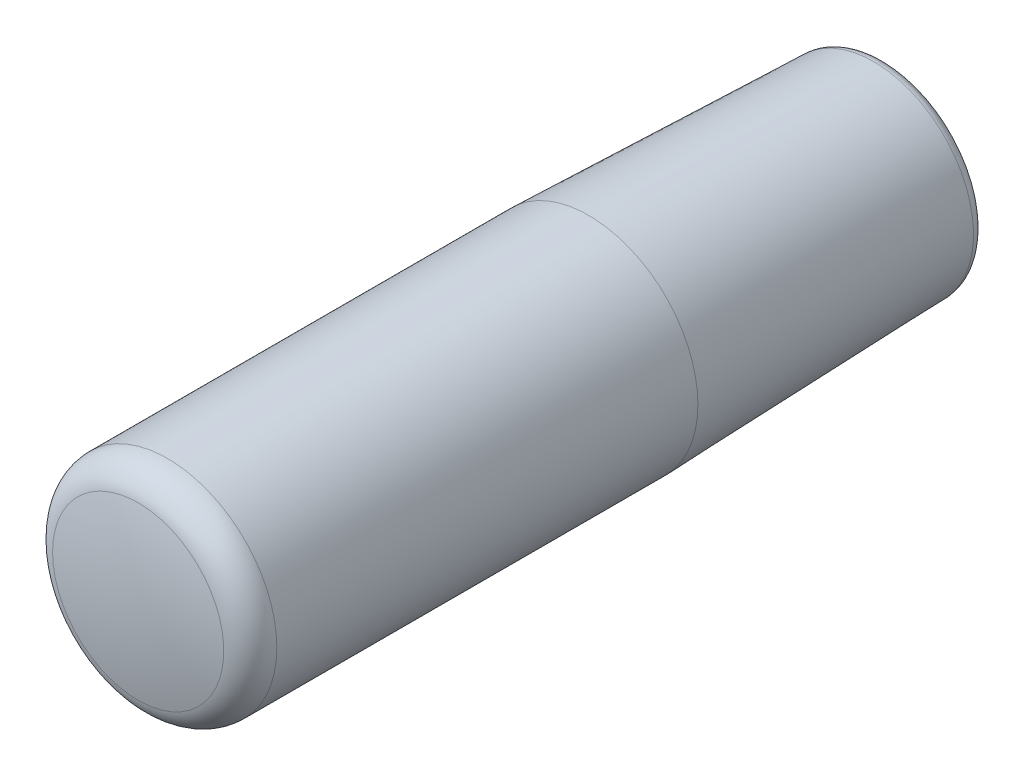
ISO-10303-21;
HEADER;
FILE_DESCRIPTION(('STEP AP214'),'2;1');
FILE_NAME('part.step','',(''),(''),'','','');
FILE_SCHEMA(('AUTOMOTIVE_DESIGN { 1 0 10303 214 1 1 1 1 }'));
ENDSEC;
DATA;
#1=APPLICATION_CONTEXT('core data for automotive mechanical design processes');
#2=APPLICATION_PROTOCOL_DEFINITION('international standard','automotive_design',2000,#1);
#3=PRODUCT_CONTEXT('',#1,'mechanical');
#4=PRODUCT('Part','Part','',(#3));
#5=PRODUCT_RELATED_PRODUCT_CATEGORY('part','',(#4));
#6=PRODUCT_DEFINITION_FORMATION('','',#4);
#7=PRODUCT_DEFINITION_CONTEXT('part definition',#1,'design');
#8=PRODUCT_DEFINITION('design','',#6,#7);
#9=PRODUCT_DEFINITION_SHAPE('','',#8);
#10=(LENGTH_UNIT() NAMED_UNIT(*) SI_UNIT(.MILLI.,.METRE.));
#11=(NAMED_UNIT(*) PLANE_ANGLE_UNIT() SI_UNIT($,.RADIAN.));
#12=(NAMED_UNIT(*) SI_UNIT($,.STERADIAN.) SOLID_ANGLE_UNIT());
#13=UNCERTAINTY_MEASURE_WITH_UNIT(LENGTH_MEASURE(1.E-05),#10,'distance_accuracy_value','');
#14=(GEOMETRIC_REPRESENTATION_CONTEXT(3) GLOBAL_UNCERTAINTY_ASSIGNED_CONTEXT((#13)) GLOBAL_UNIT_ASSIGNED_CONTEXT((#10,
#11,#12)) REPRESENTATION_CONTEXT('',''));
#15=CARTESIAN_POINT('',(0.,0.,0.));
#16=DIRECTION('',(0.,0.,1.));
#17=DIRECTION('',(1.,0.,0.));
#18=AXIS2_PLACEMENT_3D('',#15,#16,#17);
#19=CARTESIAN_POINT('',(0.,0.,1.5));
#20=DIRECTION('',(0.,0.,-1.));
#21=DIRECTION('',(-1.,0.,0.));
#22=AXIS2_PLACEMENT_3D('',#19,#20,#21);
#23=TOROIDAL_SURFACE('',#22,11.2985307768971,1.5);
#24=CARTESIAN_POINT('',(0.,0.,0.));
#25=DIRECTION('',(0.,0.,-1.));
#26=DIRECTION('',(-1.,0.,0.));
#27=AXIS2_PLACEMENT_3D('',#24,#25,#26);
#28=CIRCLE('',#27,11.2985307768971);
#29=CARTESIAN_POINT('',(-11.2985307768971,0.,0.));
#30=VERTEX_POINT('',#29);
#31=EDGE_CURVE('E8',#30,#30,#28,.T.);
#32=ORIENTED_EDGE('',*,*,#31,.F.);
#33=EDGE_LOOP('',(#32));
#34=FACE_BOUND('',#33,.T.);
#35=CARTESIAN_POINT('',(0.,0.,1.45068456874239));
#36=DIRECTION('',(0.,0.,-1.));
#37=DIRECTION('',(-1.,0.,0.));
#38=AXIS2_PLACEMENT_3D('',#35,#36,#37);
#39=CIRCLE('',#38,12.7977198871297);
#40=CARTESIAN_POINT('',(-12.7977198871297,0.,1.45068456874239));
#41=VERTEX_POINT('',#40);
#42=EDGE_CURVE('E34',#41,#41,#39,.T.);
#43=ORIENTED_EDGE('',*,*,#42,.T.);
#44=EDGE_LOOP('',(#43));
#45=FACE_BOUND('',#44,.T.);
#46=ADVANCED_FACE('F12',(#34,#45),#23,.T.);
#47=CARTESIAN_POINT('',(0.,11.2985307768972,0.));
#48=DIRECTION('',(0.,0.,1.));
#49=DIRECTION('',(1.,0.,0.));
#50=AXIS2_PLACEMENT_3D('',#47,#48,#49);
#51=PLANE('',#50);
#52=CARTESIAN_POINT('',(0.,0.,0.));
#53=DIRECTION('',(0.,0.,-1.));
#54=DIRECTION('',(-1.,0.,0.));
#55=AXIS2_PLACEMENT_3D('',#52,#53,#54);
#56=CIRCLE('',#55,6.);
#57=CARTESIAN_POINT('',(-6.,0.,0.));
#58=VERTEX_POINT('',#57);
#59=EDGE_CURVE('E18',#58,#58,#56,.T.);
#60=ORIENTED_EDGE('',*,*,#59,.F.);
#61=EDGE_LOOP('',(#60));
#62=FACE_BOUND('',#61,.T.);
#63=ORIENTED_EDGE('',*,*,#31,.T.);
#64=EDGE_LOOP('',(#63));
#65=FACE_BOUND('',#64,.T.);
#66=ADVANCED_FACE('F46',(#62,#65),#51,.F.);
#67=CARTESIAN_POINT('',(0.,0.,-5.));
#68=DIRECTION('',(0.,0.,-1.));
#69=DIRECTION('',(-1.,0.,0.));
#70=AXIS2_PLACEMENT_3D('',#67,#68,#69);
#71=CYLINDRICAL_SURFACE('',#70,6.);
#72=CARTESIAN_POINT('',(0.,0.,18.));
#73=DIRECTION('',(0.,0.,-1.));
#74=DIRECTION('',(-1.,0.,0.));
#75=AXIS2_PLACEMENT_3D('',#72,#73,#74);
#76=CIRCLE('',#75,6.);
#77=CARTESIAN_POINT('',(-6.,0.,18.));
#78=VERTEX_POINT('',#77);
#79=EDGE_CURVE('E37',#78,#78,#76,.T.);
#80=ORIENTED_EDGE('',*,*,#79,.F.);
#81=EDGE_LOOP('',(#80));
#82=FACE_BOUND('',#81,.T.);
#83=ORIENTED_EDGE('',*,*,#59,.T.);
#84=EDGE_LOOP('',(#83));
#85=FACE_BOUND('',#84,.T.);
#86=ADVANCED_FACE('F43',(#82,#85),#71,.F.);
#87=CARTESIAN_POINT('',(0.,0.,47.));
#88=DIRECTION('',(-1.,0.,0.));
#89=DIRECTION('',(0.,0.,1.));
#90=AXIS2_PLACEMENT_3D('',#87,#88,#89);
#91=SPHERICAL_SURFACE('',#90,50.);
#92=CARTESIAN_POINT('',(0.,0.,47.));
#93=DIRECTION('',(0.,0.,-1.));
#94=DIRECTION('',(-1.,0.,0.));
#95=AXIS2_PLACEMENT_3D('',#92,#93,#94);
#96=SPHERICAL_SURFACE('',#95,50.);
#97=CARTESIAN_POINT('',(0.,0.,95.7804879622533));
#98=DIRECTION('',(0.,0.,-1.));
#99=DIRECTION('',(-1.,0.,0.));
#100=AXIS2_PLACEMENT_3D('',#97,#98,#99);
#101=CIRCLE('',#100,10.9756090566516);
#102=CARTESIAN_POINT('',(-10.9756090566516,0.,95.7804879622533));
#103=VERTEX_POINT('',#102);
#104=EDGE_CURVE('E22',#103,#103,#101,.T.);
#105=ORIENTED_EDGE('',*,*,#104,.F.);
#106=EDGE_LOOP('',(#105));
#107=FACE_BOUND('',#106,.T.);
#108=ADVANCED_FACE('F45',(#107),#96,.T.);
#109=CARTESIAN_POINT('',(0.,0.,92.));
#110=DIRECTION('',(0.,0.,-1.));
#111=DIRECTION('',(-1.,0.,0.));
#112=AXIS2_PLACEMENT_3D('',#109,#110,#111);
#113=TOROIDAL_SURFACE('',#112,10.125,3.875);
#114=CARTESIAN_POINT('',(0.,0.,92.));
#115=DIRECTION('',(0.,0.,-1.));
#116=DIRECTION('',(-1.,0.,0.));
#117=AXIS2_PLACEMENT_3D('',#114,#115,#116);
#118=CIRCLE('',#117,14.);
#119=CARTESIAN_POINT('',(-14.,0.,92.));
#120=VERTEX_POINT('',#119);
#121=EDGE_CURVE('E26',#120,#120,#118,.T.);
#122=ORIENTED_EDGE('',*,*,#121,.F.);
#123=EDGE_LOOP('',(#122));
#124=FACE_BOUND('',#123,.T.);
#125=ORIENTED_EDGE('',*,*,#104,.T.);
#126=EDGE_LOOP('',(#125));
#127=FACE_BOUND('',#126,.T.);
#128=ADVANCED_FACE('F53',(#124,#127),#113,.T.);
#129=CARTESIAN_POINT('',(0.,0.,-5.));
#130=DIRECTION('',(0.,0.,-1.));
#131=DIRECTION('',(-1.,0.,0.));
#132=AXIS2_PLACEMENT_3D('',#129,#130,#131);
#133=CYLINDRICAL_SURFACE('',#132,14.);
#134=ORIENTED_EDGE('',*,*,#121,.T.);
#135=EDGE_LOOP('',(#134));
#136=FACE_BOUND('',#135,.T.);
#137=CARTESIAN_POINT('',(0.,0.,38.));
#138=DIRECTION('',(0.,0.,-1.));
#139=DIRECTION('',(-1.,0.,0.));
#140=AXIS2_PLACEMENT_3D('',#137,#138,#139);
#141=CIRCLE('',#140,14.);
#142=CARTESIAN_POINT('',(-14.,0.,38.));
#143=VERTEX_POINT('',#142);
#144=EDGE_CURVE('E31',#143,#143,#141,.T.);
#145=ORIENTED_EDGE('',*,*,#144,.F.);
#146=EDGE_LOOP('',(#145));
#147=FACE_BOUND('',#146,.T.);
#148=ADVANCED_FACE('F66',(#136,#147),#133,.T.);
#149=CARTESIAN_POINT('',(0.,0.,1.45068456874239));
#150=DIRECTION('',(0.,0.,1.));
#151=DIRECTION('',(1.,0.,0.));
#152=AXIS2_PLACEMENT_3D('',#149,#150,#151);
#153=CONICAL_SURFACE('',#152,12.7977198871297,0.0328828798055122);
#154=ORIENTED_EDGE('',*,*,#144,.T.);
#155=EDGE_LOOP('',(#154));
#156=FACE_BOUND('',#155,.T.);
#157=ORIENTED_EDGE('',*,*,#42,.F.);
#158=EDGE_LOOP('',(#157));
#159=FACE_BOUND('',#158,.T.);
#160=ADVANCED_FACE('F64',(#156,#159),#153,.T.);
#161=CARTESIAN_POINT('',(0.,0.,18.));
#162=DIRECTION('',(0.,0.,-1.));
#163=DIRECTION('',(-1.,0.,0.));
#164=AXIS2_PLACEMENT_3D('',#161,#162,#163);
#165=PLANE('',#164);
#166=ORIENTED_EDGE('',*,*,#79,.T.);
#167=EDGE_LOOP('',(#166));
#168=FACE_BOUND('',#167,.T.);
#169=ADVANCED_FACE('F41',(#168),#165,.T.);
#170=CLOSED_SHELL('',(#46,#66,#86,#108,#128,#148,#160,#169));
#171=MANIFOLD_SOLID_BREP('B1',#170);
#172=ADVANCED_BREP_SHAPE_REPRESENTATION('',(#18,#171),#14);
#173=SHAPE_DEFINITION_REPRESENTATION(#9,#172);
ENDSEC;
END-ISO-10303-21;
